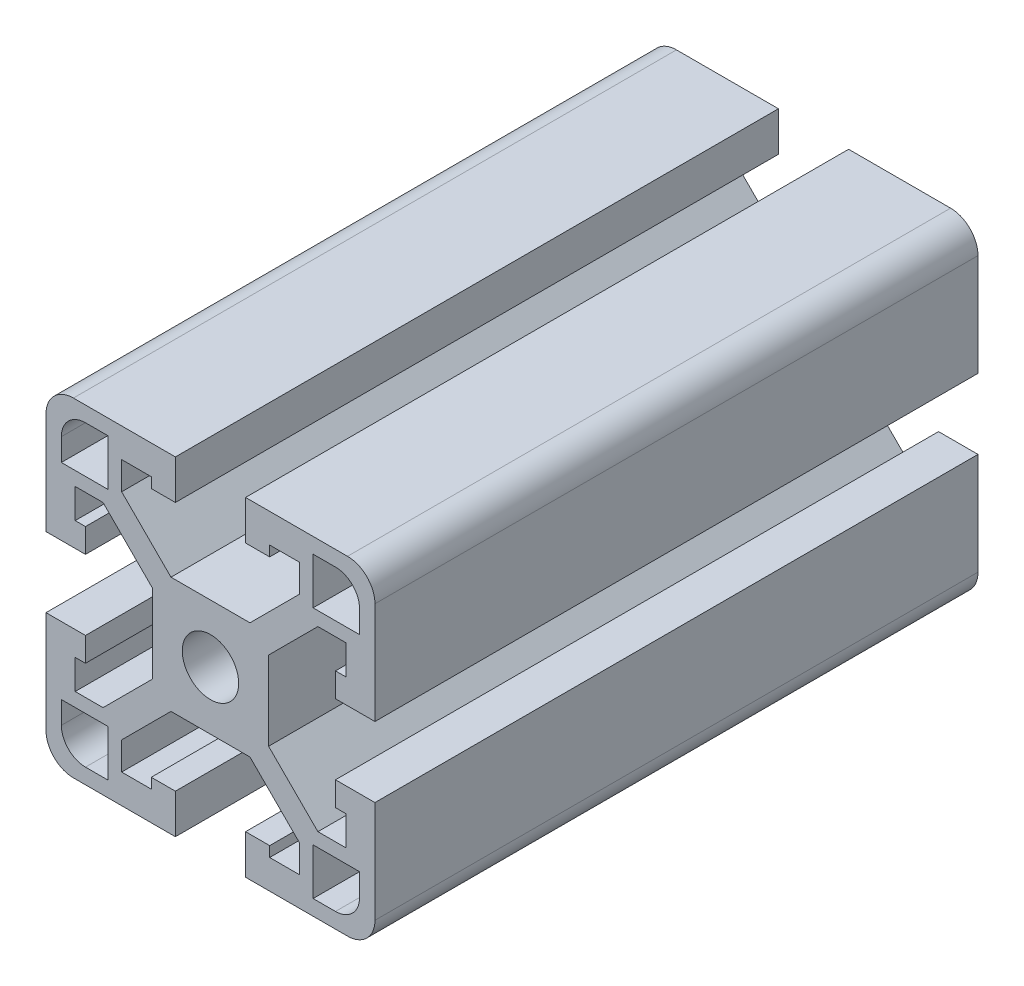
from build123d import *

# Parameters (mm, degrees)
SKETCH1_R           = 3.2639
BOSS_EXTRUDE1_DEPTH = 34.925


with BuildPart() as part:
    # Sketch1 → Boss-Extrude1 (new, symmetric)
    with BuildSketch(Plane.XY):
        with BuildLine():
            Line((-6.731, 4.575738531), (-6.731, -4.575738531))
            Line((-6.731, -4.575738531), (-12.442261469, -10.287))
            Line((-12.442261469, -10.287), (-15.6718, -10.287))
            Line((-15.6718, -10.287), (-15.6718, -6.858))
            Line((-15.6718, -6.858), (-14.478, -6.858))
            Line((-14.478, -6.858), (-14.478, -4.064))
            Line((-14.478, -4.064), (-19.05, -4.064))
            Line((-19.05, -4.064), (-19.05, -15.875))
            ThreePointArc((-19.05, -15.875), (-18.12006403, -18.12006403), (-15.875, -19.05))
            Line((-15.875, -19.05), (-4.064, -19.05))
            Line((-4.064, -19.05), (-4.064, -14.478))
            Line((-4.064, -14.478), (-6.858, -14.478))
            Line((-6.858, -14.478), (-6.858, -15.6718))
            Line((-6.858, -15.6718), (-10.287, -15.6718))
            Line((-10.287, -15.6718), (-10.287, -12.442261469))
            Line((-10.287, -12.442261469), (-4.575738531, -6.731))
            Line((-4.575738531, -6.731), (4.575738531, -6.731))
            Line((4.575738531, -6.731), (10.287, -12.442261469))
            Line((10.287, -12.442261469), (10.287, -15.6718))
            Line((10.287, -15.6718), (6.858, -15.6718))
            Line((6.858, -15.6718), (6.858, -14.478))
            Line((6.858, -14.478), (4.064, -14.478))
            Line((4.064, -14.478), (4.064, -19.05))
            Line((4.064, -19.05), (15.875, -19.05))
            ThreePointArc((15.875, -19.05), (18.12006403, -18.12006403), (19.05, -15.875))
            Line((19.05, -15.875), (19.05, -4.064))
            Line((19.05, -4.064), (14.478, -4.064))
            Line((14.478, -4.064), (14.478, -6.858))
            Line((14.478, -6.858), (15.6718, -6.858))
            Line((15.6718, -6.858), (15.6718, -10.287))
            Line((15.6718, -10.287), (12.442261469, -10.287))
            Line((12.442261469, -10.287), (6.731, -4.575738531))
            Line((6.731, -4.575738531), (6.731, 4.575738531))
            Line((6.731, 4.575738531), (12.442261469, 10.287))
            Line((12.442261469, 10.287), (15.6718, 10.287))
            Line((15.6718, 10.287), (15.6718, 6.858))
            Line((15.6718, 6.858), (14.478, 6.858))
            Line((14.478, 6.858), (14.478, 4.064))
            Line((14.478, 4.064), (19.05, 4.064))
            Line((19.05, 4.064), (19.05, 15.875))
            ThreePointArc((19.05, 15.875), (18.12006403, 18.12006403), (15.875, 19.05))
            Line((15.875, 19.05), (4.064, 19.05))
            Line((4.064, 19.05), (4.064, 14.478))
            Line((4.064, 14.478), (6.858, 14.478))
            Line((6.858, 14.478), (6.858, 15.6718))
            Line((6.858, 15.6718), (10.287, 15.6718))
            Line((10.287, 15.6718), (10.287, 12.442261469))
            Line((10.287, 12.442261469), (4.575738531, 6.731))
            Line((4.575738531, 6.731), (-4.575738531, 6.731))
            Line((-4.575738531, 6.731), (-10.287, 12.442261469))
            Line((-10.287, 12.442261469), (-10.287, 15.6718))
            Line((-10.287, 15.6718), (-6.858, 15.6718))
            Line((-6.858, 15.6718), (-6.858, 14.478))
            Line((-6.858, 14.478), (-4.064, 14.478))
            Line((-4.064, 14.478), (-4.064, 19.05))
            Line((-4.064, 19.05), (-15.875, 19.05))
            ThreePointArc((-15.875, 19.05), (-18.12006403, 18.12006403), (-19.05, 15.875))
            Line((-19.05, 15.875), (-19.05, 4.064))
            Line((-19.05, 4.064), (-14.478, 4.064))
            Line((-14.478, 4.064), (-14.478, 6.858))
            Line((-14.478, 6.858), (-15.6718, 6.858))
            Line((-15.6718, 6.858), (-15.6718, 10.287))
            Line((-15.6718, 10.287), (-12.442261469, 10.287))
            Line((-12.442261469, 10.287), (-6.731, 4.575738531))
        make_face()
        Circle(SKETCH1_R, mode=Mode.SUBTRACT)
        with BuildLine():
            Line((-11.8872, 17.272), (-14.478, 17.272))
            ThreePointArc((-14.478, 17.272), (-16.453656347, 16.453656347), (-17.272, 14.478))
            Line((-17.272, 14.478), (-17.272, 11.8872))
            Line((-17.272, 11.8872), (-11.8872, 11.8872))
            Line((-11.8872, 11.8872), (-11.8872, 17.272))
        make_face(mode=Mode.SUBTRACT)
        with BuildLine():
            Line((14.478, 17.272), (11.8872, 17.272))
            Line((11.8872, 17.272), (11.8872, 11.8872))
            Line((11.8872, 11.8872), (17.272, 11.8872))
            Line((17.272, 11.8872), (17.272, 14.478))
            ThreePointArc((17.272, 14.478), (16.453656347, 16.453656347), (14.478, 17.272))
        make_face(mode=Mode.SUBTRACT)
        with BuildLine():
            Line((11.8872, -17.272), (14.478, -17.272))
            ThreePointArc((14.478, -17.272), (16.453656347, -16.453656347), (17.272, -14.478))
            Line((17.272, -14.478), (17.272, -11.8872))
            Line((17.272, -11.8872), (11.8872, -11.8872))
            Line((11.8872, -11.8872), (11.8872, -17.272))
        make_face(mode=Mode.SUBTRACT)
        with BuildLine():
            Line((-14.478, -17.272), (-11.8872, -17.272))
            Line((-11.8872, -17.272), (-11.8872, -11.8872))
            Line((-11.8872, -11.8872), (-17.272, -11.8872))
            Line((-17.272, -11.8872), (-17.272, -14.478))
            ThreePointArc((-17.272, -14.478), (-16.453656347, -16.453656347), (-14.478, -17.272))
        make_face(mode=Mode.SUBTRACT)
    extrude(amount=BOSS_EXTRUDE1_DEPTH, both=True)


solid = part.part
